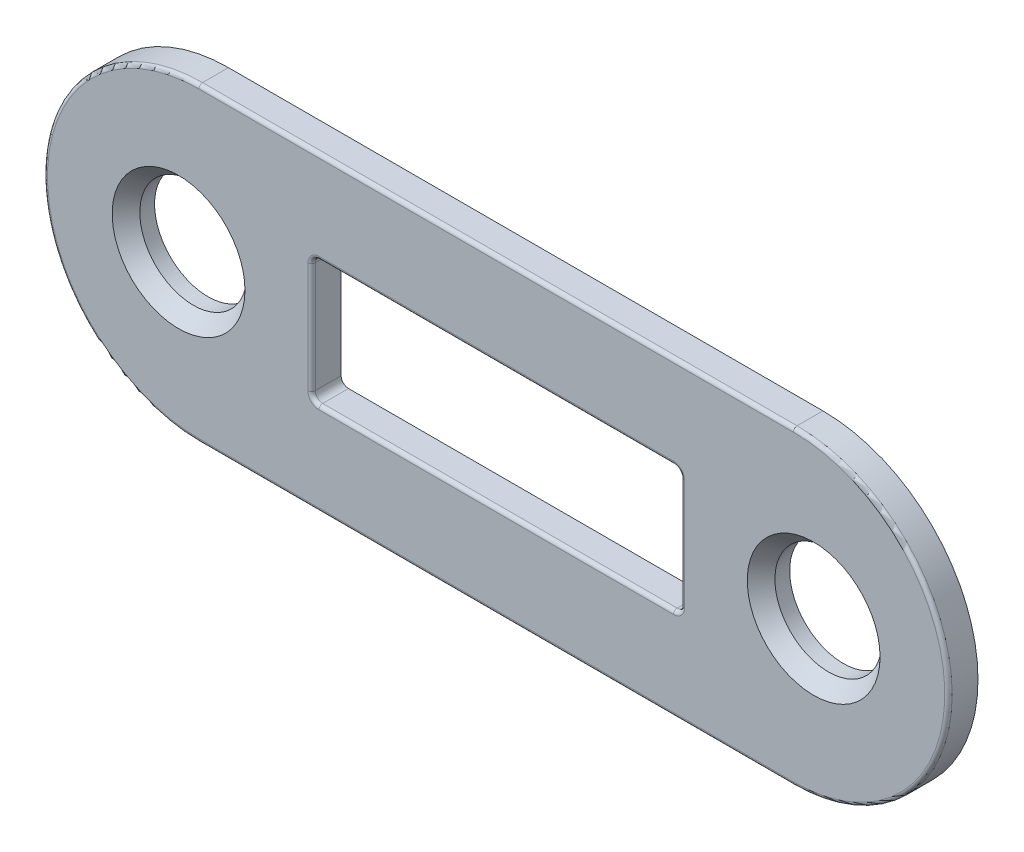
ISO-10303-21;
HEADER;
FILE_DESCRIPTION(('STEP AP214'),'2;1');
FILE_NAME('part.step','',(''),(''),'','','');
FILE_SCHEMA(('AUTOMOTIVE_DESIGN { 1 0 10303 214 1 1 1 1 }'));
ENDSEC;
DATA;
#1=APPLICATION_CONTEXT('core data for automotive mechanical design processes');
#2=APPLICATION_PROTOCOL_DEFINITION('international standard','automotive_design',2000,#1);
#3=PRODUCT_CONTEXT('',#1,'mechanical');
#4=PRODUCT('Part','Part','',(#3));
#5=PRODUCT_RELATED_PRODUCT_CATEGORY('part','',(#4));
#6=PRODUCT_DEFINITION_FORMATION('','',#4);
#7=PRODUCT_DEFINITION_CONTEXT('part definition',#1,'design');
#8=PRODUCT_DEFINITION('design','',#6,#7);
#9=PRODUCT_DEFINITION_SHAPE('','',#8);
#10=(LENGTH_UNIT() NAMED_UNIT(*) SI_UNIT(.MILLI.,.METRE.));
#11=(NAMED_UNIT(*) PLANE_ANGLE_UNIT() SI_UNIT($,.RADIAN.));
#12=(NAMED_UNIT(*) SI_UNIT($,.STERADIAN.) SOLID_ANGLE_UNIT());
#13=UNCERTAINTY_MEASURE_WITH_UNIT(LENGTH_MEASURE(1.E-05),#10,'distance_accuracy_value','');
#14=(GEOMETRIC_REPRESENTATION_CONTEXT(3) GLOBAL_UNCERTAINTY_ASSIGNED_CONTEXT((#13)) GLOBAL_UNIT_ASSIGNED_CONTEXT((#10,
#11,#12)) REPRESENTATION_CONTEXT('',''));
#15=CARTESIAN_POINT('',(0.,0.,0.));
#16=DIRECTION('',(0.,0.,1.));
#17=DIRECTION('',(1.,0.,0.));
#18=AXIS2_PLACEMENT_3D('',#15,#16,#17);
#19=CARTESIAN_POINT('',(0.,10.5,2.));
#20=DIRECTION('',(0.,0.,-1.));
#21=DIRECTION('',(-1.,0.,0.));
#22=AXIS2_PLACEMENT_3D('',#19,#20,#21);
#23=CYLINDRICAL_SURFACE('',#22,10.5);
#24=DIRECTION('',(0.,0.,-1.));
#25=VECTOR('',#24,1.);
#26=CARTESIAN_POINT('',(0.,0.,2.));
#27=LINE('',#26,#25);
#28=CARTESIAN_POINT('',(0.,0.,1.75));
#29=VERTEX_POINT('',#28);
#30=CARTESIAN_POINT('',(0.,0.,0.));
#31=VERTEX_POINT('',#30);
#32=EDGE_CURVE('E244',#29,#31,#27,.T.);
#33=ORIENTED_EDGE('',*,*,#32,.F.);
#34=CARTESIAN_POINT('',(0.,10.5,1.75));
#35=DIRECTION('',(0.,0.,1.));
#36=DIRECTION('',(1.,0.,0.));
#37=AXIS2_PLACEMENT_3D('',#34,#35,#36);
#38=CIRCLE('',#37,10.5);
#39=CARTESIAN_POINT('',(0.,21.,1.75));
#40=VERTEX_POINT('',#39);
#41=EDGE_CURVE('E262',#29,#40,#38,.F.);
#42=ORIENTED_EDGE('',*,*,#41,.T.);
#43=DIRECTION('',(0.,0.,-1.));
#44=VECTOR('',#43,1.);
#45=CARTESIAN_POINT('',(0.,21.,2.));
#46=LINE('',#45,#44);
#47=CARTESIAN_POINT('',(0.,21.,0.));
#48=VERTEX_POINT('',#47);
#49=EDGE_CURVE('E238',#40,#48,#46,.T.);
#50=ORIENTED_EDGE('',*,*,#49,.T.);
#51=CARTESIAN_POINT('',(0.,10.5,0.));
#52=DIRECTION('',(0.,0.,1.));
#53=DIRECTION('',(1.,0.,0.));
#54=AXIS2_PLACEMENT_3D('',#51,#52,#53);
#55=CIRCLE('',#54,10.5);
#56=EDGE_CURVE('E225',#48,#31,#55,.T.);
#57=ORIENTED_EDGE('',*,*,#56,.T.);
#58=EDGE_LOOP('',(#33,#42,#50,#57));
#59=FACE_BOUND('',#58,.T.);
#60=ADVANCED_FACE('F39',(#59),#23,.T.);
#61=CARTESIAN_POINT('',(0.,0.,2.));
#62=DIRECTION('',(0.,1.,0.));
#63=DIRECTION('',(-1.,0.,0.));
#64=AXIS2_PLACEMENT_3D('',#61,#62,#63);
#65=PLANE('',#64);
#66=DIRECTION('',(0.,0.,-1.));
#67=VECTOR('',#66,1.);
#68=CARTESIAN_POINT('',(40.25,0.,2.));
#69=LINE('',#68,#67);
#70=CARTESIAN_POINT('',(40.25,0.,1.75));
#71=VERTEX_POINT('',#70);
#72=CARTESIAN_POINT('',(40.25,0.,0.));
#73=VERTEX_POINT('',#72);
#74=EDGE_CURVE('E242',#71,#73,#69,.T.);
#75=ORIENTED_EDGE('',*,*,#74,.F.);
#76=DIRECTION('',(1.,0.,0.));
#77=VECTOR('',#76,1.);
#78=CARTESIAN_POINT('',(0.,0.,1.75));
#79=LINE('',#78,#77);
#80=EDGE_CURVE('E258',#71,#29,#79,.F.);
#81=ORIENTED_EDGE('',*,*,#80,.T.);
#82=ORIENTED_EDGE('',*,*,#32,.T.);
#83=DIRECTION('',(1.,0.,0.));
#84=VECTOR('',#83,1.);
#85=CARTESIAN_POINT('',(0.,0.,0.));
#86=LINE('',#85,#84);
#87=EDGE_CURVE('E228',#31,#73,#86,.T.);
#88=ORIENTED_EDGE('',*,*,#87,.T.);
#89=EDGE_LOOP('',(#75,#81,#82,#88));
#90=FACE_BOUND('',#89,.T.);
#91=ADVANCED_FACE('F389',(#90),#65,.F.);
#92=CARTESIAN_POINT('',(40.25,10.5,2.));
#93=DIRECTION('',(0.,0.,-1.));
#94=DIRECTION('',(-1.,0.,0.));
#95=AXIS2_PLACEMENT_3D('',#92,#93,#94);
#96=CYLINDRICAL_SURFACE('',#95,10.5);
#97=DIRECTION('',(0.,0.,-1.));
#98=VECTOR('',#97,1.);
#99=CARTESIAN_POINT('',(40.25,21.,2.));
#100=LINE('',#99,#98);
#101=CARTESIAN_POINT('',(40.25,21.,1.75));
#102=VERTEX_POINT('',#101);
#103=CARTESIAN_POINT('',(40.25,21.,0.));
#104=VERTEX_POINT('',#103);
#105=EDGE_CURVE('E240',#102,#104,#100,.T.);
#106=ORIENTED_EDGE('',*,*,#105,.F.);
#107=CARTESIAN_POINT('',(40.25,10.5,1.75));
#108=DIRECTION('',(0.,0.,1.));
#109=DIRECTION('',(1.,0.,0.));
#110=AXIS2_PLACEMENT_3D('',#107,#108,#109);
#111=CIRCLE('',#110,10.5);
#112=EDGE_CURVE('E260',#102,#71,#111,.F.);
#113=ORIENTED_EDGE('',*,*,#112,.T.);
#114=ORIENTED_EDGE('',*,*,#74,.T.);
#115=CARTESIAN_POINT('',(40.25,10.5,0.));
#116=DIRECTION('',(0.,0.,1.));
#117=DIRECTION('',(-1.,0.,0.));
#118=AXIS2_PLACEMENT_3D('',#115,#116,#117);
#119=CIRCLE('',#118,10.5);
#120=EDGE_CURVE('E232',#73,#104,#119,.T.);
#121=ORIENTED_EDGE('',*,*,#120,.T.);
#122=EDGE_LOOP('',(#106,#113,#114,#121));
#123=FACE_BOUND('',#122,.T.);
#124=ADVANCED_FACE('F391',(#123),#96,.T.);
#125=CARTESIAN_POINT('',(0.,21.,2.));
#126=DIRECTION('',(0.,-1.,0.));
#127=DIRECTION('',(1.,0.,0.));
#128=AXIS2_PLACEMENT_3D('',#125,#126,#127);
#129=PLANE('',#128);
#130=ORIENTED_EDGE('',*,*,#49,.F.);
#131=DIRECTION('',(-1.,0.,0.));
#132=VECTOR('',#131,1.);
#133=CARTESIAN_POINT('',(40.25,21.,1.75));
#134=LINE('',#133,#132);
#135=EDGE_CURVE('E255',#40,#102,#134,.F.);
#136=ORIENTED_EDGE('',*,*,#135,.T.);
#137=ORIENTED_EDGE('',*,*,#105,.T.);
#138=DIRECTION('',(-1.,0.,0.));
#139=VECTOR('',#138,1.);
#140=CARTESIAN_POINT('',(0.,21.,0.));
#141=LINE('',#140,#139);
#142=EDGE_CURVE('E235',#104,#48,#141,.T.);
#143=ORIENTED_EDGE('',*,*,#142,.T.);
#144=EDGE_LOOP('',(#130,#136,#137,#143));
#145=FACE_BOUND('',#144,.T.);
#146=ADVANCED_FACE('F355',(#145),#129,.F.);
#147=CARTESIAN_POINT('',(0.,10.5,2.));
#148=DIRECTION('',(0.,0.,1.));
#149=DIRECTION('',(1.,0.,0.));
#150=AXIS2_PLACEMENT_3D('',#147,#148,#149);
#151=PLANE('',#150);
#152=CARTESIAN_POINT('',(32.1299999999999,14.25,2.));
#153=DIRECTION('',(0.,0.,1.));
#154=DIRECTION('',(1.,0.,0.));
#155=AXIS2_PLACEMENT_3D('',#152,#153,#154);
#156=CIRCLE('',#155,0.750000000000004);
#157=CARTESIAN_POINT('',(32.1299999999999,15.,2.));
#158=VERTEX_POINT('',#157);
#159=CARTESIAN_POINT('',(32.8799999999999,14.25,2.));
#160=VERTEX_POINT('',#159);
#161=EDGE_CURVE('E279',#158,#160,#156,.F.);
#162=ORIENTED_EDGE('',*,*,#161,.T.);
#163=DIRECTION('',(0.,1.,0.));
#164=VECTOR('',#163,1.);
#165=CARTESIAN_POINT('',(32.8799999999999,6.75,2.));
#166=LINE('',#165,#164);
#167=CARTESIAN_POINT('',(32.8799999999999,6.75,2.));
#168=VERTEX_POINT('',#167);
#169=EDGE_CURVE('E290',#160,#168,#166,.F.);
#170=ORIENTED_EDGE('',*,*,#169,.T.);
#171=CARTESIAN_POINT('',(32.1299999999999,6.75,2.));
#172=DIRECTION('',(0.,0.,1.));
#173=DIRECTION('',(1.,0.,0.));
#174=AXIS2_PLACEMENT_3D('',#171,#172,#173);
#175=CIRCLE('',#174,0.75);
#176=CARTESIAN_POINT('',(32.1299999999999,6.,2.));
#177=VERTEX_POINT('',#176);
#178=EDGE_CURVE('E288',#168,#177,#175,.F.);
#179=ORIENTED_EDGE('',*,*,#178,.T.);
#180=DIRECTION('',(1.,0.,0.));
#181=VECTOR('',#180,1.);
#182=CARTESIAN_POINT('',(8.13,6.00000000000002,2.));
#183=LINE('',#182,#181);
#184=CARTESIAN_POINT('',(8.13,6.,2.));
#185=VERTEX_POINT('',#184);
#186=EDGE_CURVE('E286',#177,#185,#183,.F.);
#187=ORIENTED_EDGE('',*,*,#186,.T.);
#188=CARTESIAN_POINT('',(8.13,6.75,2.));
#189=DIRECTION('',(0.,0.,1.));
#190=DIRECTION('',(1.,0.,0.));
#191=AXIS2_PLACEMENT_3D('',#188,#189,#190);
#192=CIRCLE('',#191,0.750000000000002);
#193=CARTESIAN_POINT('',(7.38,6.75,2.));
#194=VERTEX_POINT('',#193);
#195=EDGE_CURVE('E284',#185,#194,#192,.F.);
#196=ORIENTED_EDGE('',*,*,#195,.T.);
#197=DIRECTION('',(0.,-1.,0.));
#198=VECTOR('',#197,1.);
#199=CARTESIAN_POINT('',(7.38,14.25,2.));
#200=LINE('',#199,#198);
#201=CARTESIAN_POINT('',(7.38,14.25,2.));
#202=VERTEX_POINT('',#201);
#203=EDGE_CURVE('E282',#194,#202,#200,.F.);
#204=ORIENTED_EDGE('',*,*,#203,.T.);
#205=CARTESIAN_POINT('',(8.13,14.25,2.));
#206=DIRECTION('',(0.,0.,1.));
#207=DIRECTION('',(1.,0.,0.));
#208=AXIS2_PLACEMENT_3D('',#205,#206,#207);
#209=CIRCLE('',#208,0.749999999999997);
#210=CARTESIAN_POINT('',(8.13,15.,2.));
#211=VERTEX_POINT('',#210);
#212=EDGE_CURVE('E277',#202,#211,#209,.F.);
#213=ORIENTED_EDGE('',*,*,#212,.T.);
#214=DIRECTION('',(-1.,0.,0.));
#215=VECTOR('',#214,1.);
#216=CARTESIAN_POINT('',(32.1299999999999,15.,2.));
#217=LINE('',#216,#215);
#218=EDGE_CURVE('E275',#211,#158,#217,.F.);
#219=ORIENTED_EDGE('',*,*,#218,.T.);
#220=EDGE_LOOP('',(#162,#170,#179,#187,#196,#204,#213,#219));
#221=FACE_BOUND('',#220,.T.);
#222=CARTESIAN_POINT('',(-1.37645353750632,10.5,2.));
#223=DIRECTION('',(0.,0.,1.));
#224=DIRECTION('',(1.,0.,0.));
#225=AXIS2_PLACEMENT_3D('',#222,#223,#224);
#226=CIRCLE('',#225,4.4958);
#227=CARTESIAN_POINT('',(3.11934646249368,10.5,2.));
#228=VERTEX_POINT('',#227);
#229=EDGE_CURVE('E334',#228,#228,#226,.T.);
#230=ORIENTED_EDGE('',*,*,#229,.F.);
#231=EDGE_LOOP('',(#230));
#232=FACE_BOUND('',#231,.T.);
#233=CARTESIAN_POINT('',(41.6235464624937,10.5,2.));
#234=DIRECTION('',(0.,0.,1.));
#235=DIRECTION('',(1.,0.,0.));
#236=AXIS2_PLACEMENT_3D('',#233,#234,#235);
#237=CIRCLE('',#236,4.4958);
#238=CARTESIAN_POINT('',(46.1193464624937,10.5,2.));
#239=VERTEX_POINT('',#238);
#240=EDGE_CURVE('E187',#239,#239,#237,.T.);
#241=ORIENTED_EDGE('',*,*,#240,.F.);
#242=EDGE_LOOP('',(#241));
#243=FACE_BOUND('',#242,.T.);
#244=DIRECTION('',(1.,0.,0.));
#245=VECTOR('',#244,1.);
#246=CARTESIAN_POINT('',(40.25,0.250000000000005,2.));
#247=LINE('',#246,#245);
#248=CARTESIAN_POINT('',(0.,0.249999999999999,2.));
#249=VERTEX_POINT('',#248);
#250=CARTESIAN_POINT('',(40.25,0.250000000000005,2.));
#251=VERTEX_POINT('',#250);
#252=EDGE_CURVE('E248',#249,#251,#247,.T.);
#253=ORIENTED_EDGE('',*,*,#252,.T.);
#254=CARTESIAN_POINT('',(40.25,10.5,2.));
#255=DIRECTION('',(0.,0.,1.));
#256=DIRECTION('',(1.,0.,0.));
#257=AXIS2_PLACEMENT_3D('',#254,#255,#256);
#258=CIRCLE('',#257,10.25);
#259=CARTESIAN_POINT('',(40.25,20.75,2.));
#260=VERTEX_POINT('',#259);
#261=EDGE_CURVE('E253',#251,#260,#258,.T.);
#262=ORIENTED_EDGE('',*,*,#261,.T.);
#263=DIRECTION('',(-1.,0.,0.));
#264=VECTOR('',#263,1.);
#265=CARTESIAN_POINT('',(0.,20.75,2.));
#266=LINE('',#265,#264);
#267=CARTESIAN_POINT('',(0.,20.75,2.));
#268=VERTEX_POINT('',#267);
#269=EDGE_CURVE('E250',#260,#268,#266,.T.);
#270=ORIENTED_EDGE('',*,*,#269,.T.);
#271=CARTESIAN_POINT('',(0.,10.5,2.));
#272=DIRECTION('',(0.,0.,1.));
#273=DIRECTION('',(1.,0.,0.));
#274=AXIS2_PLACEMENT_3D('',#271,#272,#273);
#275=CIRCLE('',#274,10.25);
#276=EDGE_CURVE('E246',#268,#249,#275,.T.);
#277=ORIENTED_EDGE('',*,*,#276,.T.);
#278=EDGE_LOOP('',(#253,#262,#270,#277));
#279=FACE_BOUND('',#278,.T.);
#280=ADVANCED_FACE('F352',(#221,#232,#243,#279),#151,.T.);
#281=CARTESIAN_POINT('',(0.,10.5,0.));
#282=DIRECTION('',(0.,0.,1.));
#283=DIRECTION('',(1.,0.,0.));
#284=AXIS2_PLACEMENT_3D('',#281,#282,#283);
#285=PLANE('',#284);
#286=CARTESIAN_POINT('',(-1.37645353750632,10.5,0.));
#287=DIRECTION('',(0.,0.,1.));
#288=DIRECTION('',(1.,0.,0.));
#289=AXIS2_PLACEMENT_3D('',#286,#287,#288);
#290=CIRCLE('',#289,3.624999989);
#291=CARTESIAN_POINT('',(2.24854645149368,10.5,0.));
#292=VERTEX_POINT('',#291);
#293=EDGE_CURVE('E323',#292,#292,#290,.T.);
#294=ORIENTED_EDGE('',*,*,#293,.T.);
#295=EDGE_LOOP('',(#294));
#296=FACE_BOUND('',#295,.T.);
#297=CARTESIAN_POINT('',(41.6235464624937,10.5,0.));
#298=DIRECTION('',(0.,0.,1.));
#299=DIRECTION('',(1.,0.,0.));
#300=AXIS2_PLACEMENT_3D('',#297,#298,#299);
#301=CIRCLE('',#300,3.624999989);
#302=CARTESIAN_POINT('',(45.2485464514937,10.5,0.));
#303=VERTEX_POINT('',#302);
#304=EDGE_CURVE('E339',#303,#303,#301,.T.);
#305=ORIENTED_EDGE('',*,*,#304,.T.);
#306=EDGE_LOOP('',(#305));
#307=FACE_BOUND('',#306,.T.);
#308=DIRECTION('',(-1.,0.,0.));
#309=VECTOR('',#308,1.);
#310=CARTESIAN_POINT('',(32.1299999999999,14.75,0.));
#311=LINE('',#310,#309);
#312=CARTESIAN_POINT('',(32.1299999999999,14.75,0.));
#313=VERTEX_POINT('',#312);
#314=CARTESIAN_POINT('',(8.13,14.75,0.));
#315=VERTEX_POINT('',#314);
#316=EDGE_CURVE('E172',#313,#315,#311,.T.);
#317=ORIENTED_EDGE('',*,*,#316,.T.);
#318=CARTESIAN_POINT('',(8.13,14.25,0.));
#319=DIRECTION('',(0.,0.,1.));
#320=DIRECTION('',(1.,0.,0.));
#321=AXIS2_PLACEMENT_3D('',#318,#319,#320);
#322=CIRCLE('',#321,0.499999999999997);
#323=CARTESIAN_POINT('',(7.63,14.25,0.));
#324=VERTEX_POINT('',#323);
#325=EDGE_CURVE('E167',#315,#324,#322,.T.);
#326=ORIENTED_EDGE('',*,*,#325,.T.);
#327=DIRECTION('',(0.,-1.,0.));
#328=VECTOR('',#327,1.);
#329=CARTESIAN_POINT('',(7.63,14.25,0.));
#330=LINE('',#329,#328);
#331=CARTESIAN_POINT('',(7.63,6.75,0.));
#332=VERTEX_POINT('',#331);
#333=EDGE_CURVE('E176',#324,#332,#330,.T.);
#334=ORIENTED_EDGE('',*,*,#333,.T.);
#335=CARTESIAN_POINT('',(8.13,6.75,0.));
#336=DIRECTION('',(0.,0.,1.));
#337=DIRECTION('',(1.,0.,0.));
#338=AXIS2_PLACEMENT_3D('',#335,#336,#337);
#339=CIRCLE('',#338,0.500000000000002);
#340=CARTESIAN_POINT('',(8.13,6.25,0.));
#341=VERTEX_POINT('',#340);
#342=EDGE_CURVE('E181',#332,#341,#339,.T.);
#343=ORIENTED_EDGE('',*,*,#342,.T.);
#344=DIRECTION('',(1.,0.,0.));
#345=VECTOR('',#344,1.);
#346=CARTESIAN_POINT('',(8.13,6.25,0.));
#347=LINE('',#346,#345);
#348=CARTESIAN_POINT('',(32.1299999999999,6.25,0.));
#349=VERTEX_POINT('',#348);
#350=EDGE_CURVE('E195',#341,#349,#347,.T.);
#351=ORIENTED_EDGE('',*,*,#350,.T.);
#352=CARTESIAN_POINT('',(32.1299999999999,6.75,0.));
#353=DIRECTION('',(0.,0.,1.));
#354=DIRECTION('',(-1.,0.,0.));
#355=AXIS2_PLACEMENT_3D('',#352,#353,#354);
#356=CIRCLE('',#355,0.5);
#357=CARTESIAN_POINT('',(32.6299999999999,6.75,0.));
#358=VERTEX_POINT('',#357);
#359=EDGE_CURVE('E198',#349,#358,#356,.T.);
#360=ORIENTED_EDGE('',*,*,#359,.T.);
#361=DIRECTION('',(0.,1.,0.));
#362=VECTOR('',#361,1.);
#363=CARTESIAN_POINT('',(32.6299999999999,6.75,0.));
#364=LINE('',#363,#362);
#365=CARTESIAN_POINT('',(32.6299999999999,14.25,0.));
#366=VERTEX_POINT('',#365);
#367=EDGE_CURVE('E201',#358,#366,#364,.T.);
#368=ORIENTED_EDGE('',*,*,#367,.T.);
#369=CARTESIAN_POINT('',(32.1299999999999,14.25,0.));
#370=DIRECTION('',(0.,0.,1.));
#371=DIRECTION('',(-1.,0.,0.));
#372=AXIS2_PLACEMENT_3D('',#369,#370,#371);
#373=CIRCLE('',#372,0.500000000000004);
#374=EDGE_CURVE('E204',#366,#313,#373,.T.);
#375=ORIENTED_EDGE('',*,*,#374,.T.);
#376=EDGE_LOOP('',(#317,#326,#334,#343,#351,#360,#368,#375));
#377=FACE_BOUND('',#376,.T.);
#378=ORIENTED_EDGE('',*,*,#56,.F.);
#379=ORIENTED_EDGE('',*,*,#142,.F.);
#380=ORIENTED_EDGE('',*,*,#120,.F.);
#381=ORIENTED_EDGE('',*,*,#87,.F.);
#382=EDGE_LOOP('',(#378,#379,#380,#381));
#383=FACE_BOUND('',#382,.T.);
#384=ADVANCED_FACE('F183',(#296,#307,#377,#383),#285,.F.);
#385=CARTESIAN_POINT('',(0.,0.25,1.75));
#386=DIRECTION('',(-1.,0.,0.));
#387=DIRECTION('',(0.,-1.,0.));
#388=AXIS2_PLACEMENT_3D('',#385,#386,#387);
#389=CYLINDRICAL_SURFACE('',#388,0.25);
#390=CARTESIAN_POINT('',(0.,0.25,1.75));
#391=DIRECTION('',(-1.,0.,0.));
#392=DIRECTION('',(0.,-1.,0.));
#393=AXIS2_PLACEMENT_3D('',#390,#391,#392);
#394=CIRCLE('',#393,0.25);
#395=EDGE_CURVE('E268',#29,#249,#394,.T.);
#396=ORIENTED_EDGE('',*,*,#395,.F.);
#397=ORIENTED_EDGE('',*,*,#80,.F.);
#398=CARTESIAN_POINT('',(40.25,0.250000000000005,1.75));
#399=DIRECTION('',(1.,0.,0.));
#400=DIRECTION('',(0.,0.,-1.));
#401=AXIS2_PLACEMENT_3D('',#398,#399,#400);
#402=CIRCLE('',#401,0.25);
#403=EDGE_CURVE('E229',#251,#71,#402,.T.);
#404=ORIENTED_EDGE('',*,*,#403,.F.);
#405=ORIENTED_EDGE('',*,*,#252,.F.);
#406=EDGE_LOOP('',(#396,#397,#404,#405));
#407=FACE_BOUND('',#406,.T.);
#408=ADVANCED_FACE('F366',(#407),#389,.T.);
#409=CARTESIAN_POINT('',(40.25,10.5,1.75));
#410=DIRECTION('',(0.,0.,1.));
#411=DIRECTION('',(1.,0.,0.));
#412=AXIS2_PLACEMENT_3D('',#409,#410,#411);
#413=TOROIDAL_SURFACE('',#412,10.25,0.25);
#414=ORIENTED_EDGE('',*,*,#403,.T.);
#415=ORIENTED_EDGE('',*,*,#112,.F.);
#416=CARTESIAN_POINT('',(40.25,20.75,1.75));
#417=DIRECTION('',(-1.,0.,0.));
#418=DIRECTION('',(0.,0.,1.));
#419=AXIS2_PLACEMENT_3D('',#416,#417,#418);
#420=CIRCLE('',#419,0.25);
#421=EDGE_CURVE('E266',#260,#102,#420,.T.);
#422=ORIENTED_EDGE('',*,*,#421,.F.);
#423=ORIENTED_EDGE('',*,*,#261,.F.);
#424=EDGE_LOOP('',(#414,#415,#422,#423));
#425=FACE_BOUND('',#424,.T.);
#426=ADVANCED_FACE('F369',(#425),#413,.T.);
#427=CARTESIAN_POINT('',(0.,10.5,1.75));
#428=DIRECTION('',(0.,0.,1.));
#429=DIRECTION('',(1.,0.,0.));
#430=AXIS2_PLACEMENT_3D('',#427,#428,#429);
#431=TOROIDAL_SURFACE('',#430,10.25,0.25);
#432=ORIENTED_EDGE('',*,*,#395,.T.);
#433=ORIENTED_EDGE('',*,*,#276,.F.);
#434=CARTESIAN_POINT('',(0.,20.75,1.75));
#435=DIRECTION('',(1.,0.,0.));
#436=DIRECTION('',(0.,0.,-1.));
#437=AXIS2_PLACEMENT_3D('',#434,#435,#436);
#438=CIRCLE('',#437,0.25);
#439=EDGE_CURVE('E209',#40,#268,#438,.T.);
#440=ORIENTED_EDGE('',*,*,#439,.F.);
#441=ORIENTED_EDGE('',*,*,#41,.F.);
#442=EDGE_LOOP('',(#432,#433,#440,#441));
#443=FACE_BOUND('',#442,.T.);
#444=ADVANCED_FACE('F377',(#443),#431,.T.);
#445=CARTESIAN_POINT('',(0.,20.75,1.75));
#446=DIRECTION('',(1.,0.,0.));
#447=DIRECTION('',(0.,1.,0.));
#448=AXIS2_PLACEMENT_3D('',#445,#446,#447);
#449=CYLINDRICAL_SURFACE('',#448,0.25);
#450=ORIENTED_EDGE('',*,*,#421,.T.);
#451=ORIENTED_EDGE('',*,*,#135,.F.);
#452=ORIENTED_EDGE('',*,*,#439,.T.);
#453=ORIENTED_EDGE('',*,*,#269,.F.);
#454=EDGE_LOOP('',(#450,#451,#452,#453));
#455=FACE_BOUND('',#454,.T.);
#456=ADVANCED_FACE('F373',(#455),#449,.T.);
#457=CARTESIAN_POINT('',(8.13,14.25,0.));
#458=DIRECTION('',(0.,0.,1.));
#459=DIRECTION('',(1.,0.,0.));
#460=AXIS2_PLACEMENT_3D('',#457,#458,#459);
#461=CYLINDRICAL_SURFACE('',#460,0.499999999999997);
#462=DIRECTION('',(0.,0.,1.));
#463=VECTOR('',#462,1.);
#464=CARTESIAN_POINT('',(8.13,14.75,0.));
#465=LINE('',#464,#463);
#466=CARTESIAN_POINT('',(8.13,14.75,1.75));
#467=VERTEX_POINT('',#466);
#468=EDGE_CURVE('E207',#315,#467,#465,.T.);
#469=ORIENTED_EDGE('',*,*,#468,.T.);
#470=CARTESIAN_POINT('',(8.13,14.25,1.75));
#471=DIRECTION('',(0.,0.,1.));
#472=DIRECTION('',(1.,0.,0.));
#473=AXIS2_PLACEMENT_3D('',#470,#471,#472);
#474=CIRCLE('',#473,0.499999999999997);
#475=CARTESIAN_POINT('',(7.63,14.25,1.75));
#476=VERTEX_POINT('',#475);
#477=EDGE_CURVE('E61',#467,#476,#474,.T.);
#478=ORIENTED_EDGE('',*,*,#477,.T.);
#479=DIRECTION('',(0.,0.,1.));
#480=VECTOR('',#479,1.);
#481=CARTESIAN_POINT('',(7.63,14.25,0.));
#482=LINE('',#481,#480);
#483=EDGE_CURVE('E163',#324,#476,#482,.T.);
#484=ORIENTED_EDGE('',*,*,#483,.F.);
#485=ORIENTED_EDGE('',*,*,#325,.F.);
#486=EDGE_LOOP('',(#469,#478,#484,#485));
#487=FACE_BOUND('',#486,.T.);
#488=ADVANCED_FACE('F165',(#487),#461,.F.);
#489=CARTESIAN_POINT('',(12.8001449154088,14.75,0.));
#490=DIRECTION('',(0.,1.,0.));
#491=DIRECTION('',(-1.,0.,0.));
#492=AXIS2_PLACEMENT_3D('',#489,#490,#491);
#493=PLANE('',#492);
#494=DIRECTION('',(0.,0.,1.));
#495=VECTOR('',#494,1.);
#496=CARTESIAN_POINT('',(32.1299999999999,14.75,0.));
#497=LINE('',#496,#495);
#498=CARTESIAN_POINT('',(32.1299999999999,14.75,1.75));
#499=VERTEX_POINT('',#498);
#500=EDGE_CURVE('E210',#313,#499,#497,.T.);
#501=ORIENTED_EDGE('',*,*,#500,.T.);
#502=DIRECTION('',(-1.,0.,0.));
#503=VECTOR('',#502,1.);
#504=CARTESIAN_POINT('',(8.13,14.75,1.75));
#505=LINE('',#504,#503);
#506=EDGE_CURVE('E11',#499,#467,#505,.T.);
#507=ORIENTED_EDGE('',*,*,#506,.T.);
#508=ORIENTED_EDGE('',*,*,#468,.F.);
#509=ORIENTED_EDGE('',*,*,#316,.F.);
#510=EDGE_LOOP('',(#501,#507,#508,#509));
#511=FACE_BOUND('',#510,.T.);
#512=ADVANCED_FACE('F482',(#511),#493,.F.);
#513=CARTESIAN_POINT('',(32.1299999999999,14.25,0.));
#514=DIRECTION('',(0.,0.,1.));
#515=DIRECTION('',(1.,0.,0.));
#516=AXIS2_PLACEMENT_3D('',#513,#514,#515);
#517=CYLINDRICAL_SURFACE('',#516,0.500000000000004);
#518=DIRECTION('',(0.,0.,1.));
#519=VECTOR('',#518,1.);
#520=CARTESIAN_POINT('',(32.6299999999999,14.25,0.));
#521=LINE('',#520,#519);
#522=CARTESIAN_POINT('',(32.6299999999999,14.25,1.75));
#523=VERTEX_POINT('',#522);
#524=EDGE_CURVE('E212',#366,#523,#521,.T.);
#525=ORIENTED_EDGE('',*,*,#524,.T.);
#526=CARTESIAN_POINT('',(32.1299999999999,14.25,1.75));
#527=DIRECTION('',(0.,0.,1.));
#528=DIRECTION('',(1.,0.,0.));
#529=AXIS2_PLACEMENT_3D('',#526,#527,#528);
#530=CIRCLE('',#529,0.500000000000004);
#531=EDGE_CURVE('E264',#523,#499,#530,.T.);
#532=ORIENTED_EDGE('',*,*,#531,.T.);
#533=ORIENTED_EDGE('',*,*,#500,.F.);
#534=ORIENTED_EDGE('',*,*,#374,.F.);
#535=EDGE_LOOP('',(#525,#532,#533,#534));
#536=FACE_BOUND('',#535,.T.);
#537=ADVANCED_FACE('F500',(#536),#517,.F.);
#538=CARTESIAN_POINT('',(32.6299999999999,10.5,0.));
#539=DIRECTION('',(1.,0.,0.));
#540=DIRECTION('',(0.,1.,0.));
#541=AXIS2_PLACEMENT_3D('',#538,#539,#540);
#542=PLANE('',#541);
#543=DIRECTION('',(0.,0.,1.));
#544=VECTOR('',#543,1.);
#545=CARTESIAN_POINT('',(32.6299999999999,6.75,0.));
#546=LINE('',#545,#544);
#547=CARTESIAN_POINT('',(32.6299999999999,6.75,1.75));
#548=VERTEX_POINT('',#547);
#549=EDGE_CURVE('E215',#358,#548,#546,.T.);
#550=ORIENTED_EDGE('',*,*,#549,.T.);
#551=DIRECTION('',(0.,1.,0.));
#552=VECTOR('',#551,1.);
#553=CARTESIAN_POINT('',(32.6299999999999,14.25,1.75));
#554=LINE('',#553,#552);
#555=EDGE_CURVE('E292',#548,#523,#554,.T.);
#556=ORIENTED_EDGE('',*,*,#555,.T.);
#557=ORIENTED_EDGE('',*,*,#524,.F.);
#558=ORIENTED_EDGE('',*,*,#367,.F.);
#559=EDGE_LOOP('',(#550,#556,#557,#558));
#560=FACE_BOUND('',#559,.T.);
#561=ADVANCED_FACE('F464',(#560),#542,.F.);
#562=CARTESIAN_POINT('',(32.1299999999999,6.75,0.));
#563=DIRECTION('',(0.,0.,1.));
#564=DIRECTION('',(1.,0.,0.));
#565=AXIS2_PLACEMENT_3D('',#562,#563,#564);
#566=CYLINDRICAL_SURFACE('',#565,0.5);
#567=DIRECTION('',(0.,0.,1.));
#568=VECTOR('',#567,1.);
#569=CARTESIAN_POINT('',(32.1299999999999,6.25,0.));
#570=LINE('',#569,#568);
#571=CARTESIAN_POINT('',(32.1299999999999,6.25,1.75));
#572=VERTEX_POINT('',#571);
#573=EDGE_CURVE('E218',#349,#572,#570,.T.);
#574=ORIENTED_EDGE('',*,*,#573,.T.);
#575=CARTESIAN_POINT('',(32.1299999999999,6.75,1.75));
#576=DIRECTION('',(0.,0.,1.));
#577=DIRECTION('',(1.,0.,0.));
#578=AXIS2_PLACEMENT_3D('',#575,#576,#577);
#579=CIRCLE('',#578,0.5);
#580=EDGE_CURVE('E294',#572,#548,#579,.T.);
#581=ORIENTED_EDGE('',*,*,#580,.T.);
#582=ORIENTED_EDGE('',*,*,#549,.F.);
#583=ORIENTED_EDGE('',*,*,#359,.F.);
#584=EDGE_LOOP('',(#574,#581,#582,#583));
#585=FACE_BOUND('',#584,.T.);
#586=ADVANCED_FACE('F460',(#585),#566,.F.);
#587=CARTESIAN_POINT('',(27.4498550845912,6.25,0.));
#588=DIRECTION('',(0.,-1.,0.));
#589=DIRECTION('',(1.,0.,0.));
#590=AXIS2_PLACEMENT_3D('',#587,#588,#589);
#591=PLANE('',#590);
#592=DIRECTION('',(0.,0.,1.));
#593=VECTOR('',#592,1.);
#594=CARTESIAN_POINT('',(8.13,6.25,0.));
#595=LINE('',#594,#593);
#596=CARTESIAN_POINT('',(8.13,6.25,1.75));
#597=VERTEX_POINT('',#596);
#598=EDGE_CURVE('E221',#341,#597,#595,.T.);
#599=ORIENTED_EDGE('',*,*,#598,.T.);
#600=DIRECTION('',(1.,0.,0.));
#601=VECTOR('',#600,1.);
#602=CARTESIAN_POINT('',(32.1299999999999,6.25,1.75));
#603=LINE('',#602,#601);
#604=EDGE_CURVE('E296',#597,#572,#603,.T.);
#605=ORIENTED_EDGE('',*,*,#604,.T.);
#606=ORIENTED_EDGE('',*,*,#573,.F.);
#607=ORIENTED_EDGE('',*,*,#350,.F.);
#608=EDGE_LOOP('',(#599,#605,#606,#607));
#609=FACE_BOUND('',#608,.T.);
#610=ADVANCED_FACE('F468',(#609),#591,.F.);
#611=CARTESIAN_POINT('',(8.13,6.75,0.));
#612=DIRECTION('',(0.,0.,1.));
#613=DIRECTION('',(1.,0.,0.));
#614=AXIS2_PLACEMENT_3D('',#611,#612,#613);
#615=CYLINDRICAL_SURFACE('',#614,0.500000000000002);
#616=DIRECTION('',(0.,0.,1.));
#617=VECTOR('',#616,1.);
#618=CARTESIAN_POINT('',(7.63,6.75,0.));
#619=LINE('',#618,#617);
#620=CARTESIAN_POINT('',(7.63,6.75,1.75));
#621=VERTEX_POINT('',#620);
#622=EDGE_CURVE('E171',#332,#621,#619,.T.);
#623=ORIENTED_EDGE('',*,*,#622,.T.);
#624=CARTESIAN_POINT('',(8.13,6.75,1.75));
#625=DIRECTION('',(0.,0.,1.));
#626=DIRECTION('',(1.,0.,0.));
#627=AXIS2_PLACEMENT_3D('',#624,#625,#626);
#628=CIRCLE('',#627,0.500000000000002);
#629=EDGE_CURVE('E298',#621,#597,#628,.T.);
#630=ORIENTED_EDGE('',*,*,#629,.T.);
#631=ORIENTED_EDGE('',*,*,#598,.F.);
#632=ORIENTED_EDGE('',*,*,#342,.F.);
#633=EDGE_LOOP('',(#623,#630,#631,#632));
#634=FACE_BOUND('',#633,.T.);
#635=ADVANCED_FACE('F470',(#634),#615,.F.);
#636=CARTESIAN_POINT('',(7.63,10.5,0.));
#637=DIRECTION('',(-1.,0.,0.));
#638=DIRECTION('',(0.,0.,1.));
#639=AXIS2_PLACEMENT_3D('',#636,#637,#638);
#640=PLANE('',#639);
#641=ORIENTED_EDGE('',*,*,#483,.T.);
#642=DIRECTION('',(0.,-1.,0.));
#643=VECTOR('',#642,1.);
#644=CARTESIAN_POINT('',(7.63,6.75,1.75));
#645=LINE('',#644,#643);
#646=EDGE_CURVE('E48',#476,#621,#645,.T.);
#647=ORIENTED_EDGE('',*,*,#646,.T.);
#648=ORIENTED_EDGE('',*,*,#622,.F.);
#649=ORIENTED_EDGE('',*,*,#333,.F.);
#650=EDGE_LOOP('',(#641,#647,#648,#649));
#651=FACE_BOUND('',#650,.T.);
#652=ADVANCED_FACE('F177',(#651),#640,.F.);
#653=CARTESIAN_POINT('',(41.6235464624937,10.5,2.));
#654=DIRECTION('',(0.,0.,1.));
#655=DIRECTION('',(1.,0.,0.));
#656=AXIS2_PLACEMENT_3D('',#653,#654,#655);
#657=CONICAL_SURFACE('',#656,4.4958,0.715584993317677);
#658=CARTESIAN_POINT('',(41.6235464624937,10.5,0.998259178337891));
#659=DIRECTION('',(0.,0.,1.));
#660=DIRECTION('',(1.,0.,0.));
#661=AXIS2_PLACEMENT_3D('',#658,#659,#660);
#662=CIRCLE('',#661,3.624999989);
#663=CARTESIAN_POINT('',(45.2485464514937,10.5,0.998259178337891));
#664=VERTEX_POINT('',#663);
#665=EDGE_CURVE('E190',#664,#664,#662,.T.);
#666=ORIENTED_EDGE('',*,*,#665,.F.);
#667=EDGE_LOOP('',(#666));
#668=FACE_BOUND('',#667,.T.);
#669=ORIENTED_EDGE('',*,*,#240,.T.);
#670=EDGE_LOOP('',(#669));
#671=FACE_BOUND('',#670,.T.);
#672=ADVANCED_FACE('F346',(#668,#671),#657,.F.);
#673=CARTESIAN_POINT('',(41.6235464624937,10.5,2.));
#674=DIRECTION('',(0.,0.,1.));
#675=DIRECTION('',(1.,0.,0.));
#676=AXIS2_PLACEMENT_3D('',#673,#674,#675);
#677=CYLINDRICAL_SURFACE('',#676,3.624999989);
#678=ORIENTED_EDGE('',*,*,#304,.F.);
#679=EDGE_LOOP('',(#678));
#680=FACE_BOUND('',#679,.T.);
#681=ORIENTED_EDGE('',*,*,#665,.T.);
#682=EDGE_LOOP('',(#681));
#683=FACE_BOUND('',#682,.T.);
#684=ADVANCED_FACE('F344',(#680,#683),#677,.F.);
#685=CARTESIAN_POINT('',(-1.37645353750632,10.5,2.));
#686=DIRECTION('',(0.,0.,1.));
#687=DIRECTION('',(1.,0.,0.));
#688=AXIS2_PLACEMENT_3D('',#685,#686,#687);
#689=CONICAL_SURFACE('',#688,4.4958,0.715584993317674);
#690=CARTESIAN_POINT('',(-1.37645353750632,10.5,0.998259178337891));
#691=DIRECTION('',(0.,0.,1.));
#692=DIRECTION('',(1.,0.,0.));
#693=AXIS2_PLACEMENT_3D('',#690,#691,#692);
#694=CIRCLE('',#693,3.624999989);
#695=CARTESIAN_POINT('',(2.24854645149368,10.5,0.998259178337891));
#696=VERTEX_POINT('',#695);
#697=EDGE_CURVE('E329',#696,#696,#694,.T.);
#698=ORIENTED_EDGE('',*,*,#697,.F.);
#699=EDGE_LOOP('',(#698));
#700=FACE_BOUND('',#699,.T.);
#701=ORIENTED_EDGE('',*,*,#229,.T.);
#702=EDGE_LOOP('',(#701));
#703=FACE_BOUND('',#702,.T.);
#704=ADVANCED_FACE('F445',(#700,#703),#689,.F.);
#705=CARTESIAN_POINT('',(-1.37645353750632,10.5,2.));
#706=DIRECTION('',(0.,0.,1.));
#707=DIRECTION('',(1.,0.,0.));
#708=AXIS2_PLACEMENT_3D('',#705,#706,#707);
#709=CYLINDRICAL_SURFACE('',#708,3.624999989);
#710=ORIENTED_EDGE('',*,*,#293,.F.);
#711=EDGE_LOOP('',(#710));
#712=FACE_BOUND('',#711,.T.);
#713=ORIENTED_EDGE('',*,*,#697,.T.);
#714=EDGE_LOOP('',(#713));
#715=FACE_BOUND('',#714,.T.);
#716=ADVANCED_FACE('F440',(#712,#715),#709,.F.);
#717=CARTESIAN_POINT('',(8.13,6.75,1.75));
#718=DIRECTION('',(0.,0.,1.));
#719=DIRECTION('',(1.,0.,0.));
#720=AXIS2_PLACEMENT_3D('',#717,#718,#719);
#721=TOROIDAL_SURFACE('',#720,0.750000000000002,0.25);
#722=CARTESIAN_POINT('',(7.38,6.75,1.75));
#723=DIRECTION('',(0.,1.,0.));
#724=DIRECTION('',(0.,0.,1.));
#725=AXIS2_PLACEMENT_3D('',#722,#723,#724);
#726=CIRCLE('',#725,0.25);
#727=EDGE_CURVE('E317',#194,#621,#726,.T.);
#728=ORIENTED_EDGE('',*,*,#727,.F.);
#729=ORIENTED_EDGE('',*,*,#195,.F.);
#730=CARTESIAN_POINT('',(8.13,6.,1.75));
#731=DIRECTION('',(1.,0.,0.));
#732=DIRECTION('',(0.,0.,-1.));
#733=AXIS2_PLACEMENT_3D('',#730,#731,#732);
#734=CIRCLE('',#733,0.25);
#735=EDGE_CURVE('E43',#597,#185,#734,.T.);
#736=ORIENTED_EDGE('',*,*,#735,.F.);
#737=ORIENTED_EDGE('',*,*,#629,.F.);
#738=EDGE_LOOP('',(#728,#729,#736,#737));
#739=FACE_BOUND('',#738,.T.);
#740=ADVANCED_FACE('F41',(#739),#721,.T.);
#741=CARTESIAN_POINT('',(27.4498550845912,6.,1.75));
#742=DIRECTION('',(-1.,0.,0.));
#743=DIRECTION('',(0.,-1.,0.));
#744=AXIS2_PLACEMENT_3D('',#741,#742,#743);
#745=CYLINDRICAL_SURFACE('',#744,0.25);
#746=ORIENTED_EDGE('',*,*,#735,.T.);
#747=ORIENTED_EDGE('',*,*,#186,.F.);
#748=CARTESIAN_POINT('',(32.1299999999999,6.,1.75));
#749=DIRECTION('',(1.,0.,0.));
#750=DIRECTION('',(0.,0.,-1.));
#751=AXIS2_PLACEMENT_3D('',#748,#749,#750);
#752=CIRCLE('',#751,0.25);
#753=EDGE_CURVE('E315',#572,#177,#752,.T.);
#754=ORIENTED_EDGE('',*,*,#753,.F.);
#755=ORIENTED_EDGE('',*,*,#604,.F.);
#756=EDGE_LOOP('',(#746,#747,#754,#755));
#757=FACE_BOUND('',#756,.T.);
#758=ADVANCED_FACE('F435',(#757),#745,.T.);
#759=CARTESIAN_POINT('',(7.38,10.5,1.75));
#760=DIRECTION('',(0.,1.,0.));
#761=DIRECTION('',(0.,0.,1.));
#762=AXIS2_PLACEMENT_3D('',#759,#760,#761);
#763=CYLINDRICAL_SURFACE('',#762,0.25);
#764=ORIENTED_EDGE('',*,*,#727,.T.);
#765=ORIENTED_EDGE('',*,*,#646,.F.);
#766=CARTESIAN_POINT('',(7.38,14.25,1.75));
#767=DIRECTION('',(0.,1.,0.));
#768=DIRECTION('',(0.,0.,1.));
#769=AXIS2_PLACEMENT_3D('',#766,#767,#768);
#770=CIRCLE('',#769,0.25);
#771=EDGE_CURVE('E312',#202,#476,#770,.T.);
#772=ORIENTED_EDGE('',*,*,#771,.F.);
#773=ORIENTED_EDGE('',*,*,#203,.F.);
#774=EDGE_LOOP('',(#764,#765,#772,#773));
#775=FACE_BOUND('',#774,.T.);
#776=ADVANCED_FACE('F432',(#775),#763,.T.);
#777=CARTESIAN_POINT('',(32.1299999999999,6.75,1.75));
#778=DIRECTION('',(0.,0.,1.));
#779=DIRECTION('',(1.,0.,0.));
#780=AXIS2_PLACEMENT_3D('',#777,#778,#779);
#781=TOROIDAL_SURFACE('',#780,0.75,0.25);
#782=ORIENTED_EDGE('',*,*,#753,.T.);
#783=ORIENTED_EDGE('',*,*,#178,.F.);
#784=CARTESIAN_POINT('',(32.8799999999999,6.75,1.75));
#785=DIRECTION('',(0.,1.,0.));
#786=DIRECTION('',(0.,0.,1.));
#787=AXIS2_PLACEMENT_3D('',#784,#785,#786);
#788=CIRCLE('',#787,0.25);
#789=EDGE_CURVE('E309',#548,#168,#788,.T.);
#790=ORIENTED_EDGE('',*,*,#789,.F.);
#791=ORIENTED_EDGE('',*,*,#580,.F.);
#792=EDGE_LOOP('',(#782,#783,#790,#791));
#793=FACE_BOUND('',#792,.T.);
#794=ADVANCED_FACE('F428',(#793),#781,.T.);
#795=CARTESIAN_POINT('',(8.13,14.25,1.75));
#796=DIRECTION('',(0.,0.,1.));
#797=DIRECTION('',(1.,0.,0.));
#798=AXIS2_PLACEMENT_3D('',#795,#796,#797);
#799=TOROIDAL_SURFACE('',#798,0.749999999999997,0.25);
#800=ORIENTED_EDGE('',*,*,#771,.T.);
#801=ORIENTED_EDGE('',*,*,#477,.F.);
#802=CARTESIAN_POINT('',(8.13,15.,1.75));
#803=DIRECTION('',(1.,0.,0.));
#804=DIRECTION('',(0.,1.,0.));
#805=AXIS2_PLACEMENT_3D('',#802,#803,#804);
#806=CIRCLE('',#805,0.25);
#807=EDGE_CURVE('E306',#211,#467,#806,.T.);
#808=ORIENTED_EDGE('',*,*,#807,.F.);
#809=ORIENTED_EDGE('',*,*,#212,.F.);
#810=EDGE_LOOP('',(#800,#801,#808,#809));
#811=FACE_BOUND('',#810,.T.);
#812=ADVANCED_FACE('F424',(#811),#799,.T.);
#813=CARTESIAN_POINT('',(32.8799999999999,10.5,1.75));
#814=DIRECTION('',(0.,-1.,0.));
#815=DIRECTION('',(1.,0.,0.));
#816=AXIS2_PLACEMENT_3D('',#813,#814,#815);
#817=CYLINDRICAL_SURFACE('',#816,0.25);
#818=ORIENTED_EDGE('',*,*,#789,.T.);
#819=ORIENTED_EDGE('',*,*,#169,.F.);
#820=CARTESIAN_POINT('',(32.8799999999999,14.25,1.75));
#821=DIRECTION('',(0.,1.,0.));
#822=DIRECTION('',(0.,0.,1.));
#823=AXIS2_PLACEMENT_3D('',#820,#821,#822);
#824=CIRCLE('',#823,0.25);
#825=EDGE_CURVE('E304',#523,#160,#824,.T.);
#826=ORIENTED_EDGE('',*,*,#825,.F.);
#827=ORIENTED_EDGE('',*,*,#555,.F.);
#828=EDGE_LOOP('',(#818,#819,#826,#827));
#829=FACE_BOUND('',#828,.T.);
#830=ADVANCED_FACE('F420',(#829),#817,.T.);
#831=CARTESIAN_POINT('',(12.8001449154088,15.,1.75));
#832=DIRECTION('',(1.,0.,0.));
#833=DIRECTION('',(0.,1.,0.));
#834=AXIS2_PLACEMENT_3D('',#831,#832,#833);
#835=CYLINDRICAL_SURFACE('',#834,0.25);
#836=ORIENTED_EDGE('',*,*,#807,.T.);
#837=ORIENTED_EDGE('',*,*,#506,.F.);
#838=CARTESIAN_POINT('',(32.1299999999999,15.,1.75));
#839=DIRECTION('',(1.,0.,0.));
#840=DIRECTION('',(0.,0.,-1.));
#841=AXIS2_PLACEMENT_3D('',#838,#839,#840);
#842=CIRCLE('',#841,0.25);
#843=EDGE_CURVE('E302',#158,#499,#842,.T.);
#844=ORIENTED_EDGE('',*,*,#843,.F.);
#845=ORIENTED_EDGE('',*,*,#218,.F.);
#846=EDGE_LOOP('',(#836,#837,#844,#845));
#847=FACE_BOUND('',#846,.T.);
#848=ADVANCED_FACE('F416',(#847),#835,.T.);
#849=CARTESIAN_POINT('',(32.1299999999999,14.25,1.75));
#850=DIRECTION('',(0.,0.,1.));
#851=DIRECTION('',(1.,0.,0.));
#852=AXIS2_PLACEMENT_3D('',#849,#850,#851);
#853=TOROIDAL_SURFACE('',#852,0.750000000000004,0.25);
#854=ORIENTED_EDGE('',*,*,#825,.T.);
#855=ORIENTED_EDGE('',*,*,#161,.F.);
#856=ORIENTED_EDGE('',*,*,#843,.T.);
#857=ORIENTED_EDGE('',*,*,#531,.F.);
#858=EDGE_LOOP('',(#854,#855,#856,#857));
#859=FACE_BOUND('',#858,.T.);
#860=ADVANCED_FACE('F413',(#859),#853,.T.);
#861=CLOSED_SHELL('',(#60,#91,#124,#146,#280,#384,#408,#426,#444,#456,#488,#512,#537,#561,#586,
#610,#635,#652,#672,#684,#704,#716,#740,#758,#776,#794,#812,#830,#848,#860));
#862=MANIFOLD_SOLID_BREP('B2',#861);
#863=ADVANCED_BREP_SHAPE_REPRESENTATION('',(#18,#862),#14);
#864=SHAPE_DEFINITION_REPRESENTATION(#9,#863);
ENDSEC;
END-ISO-10303-21;
